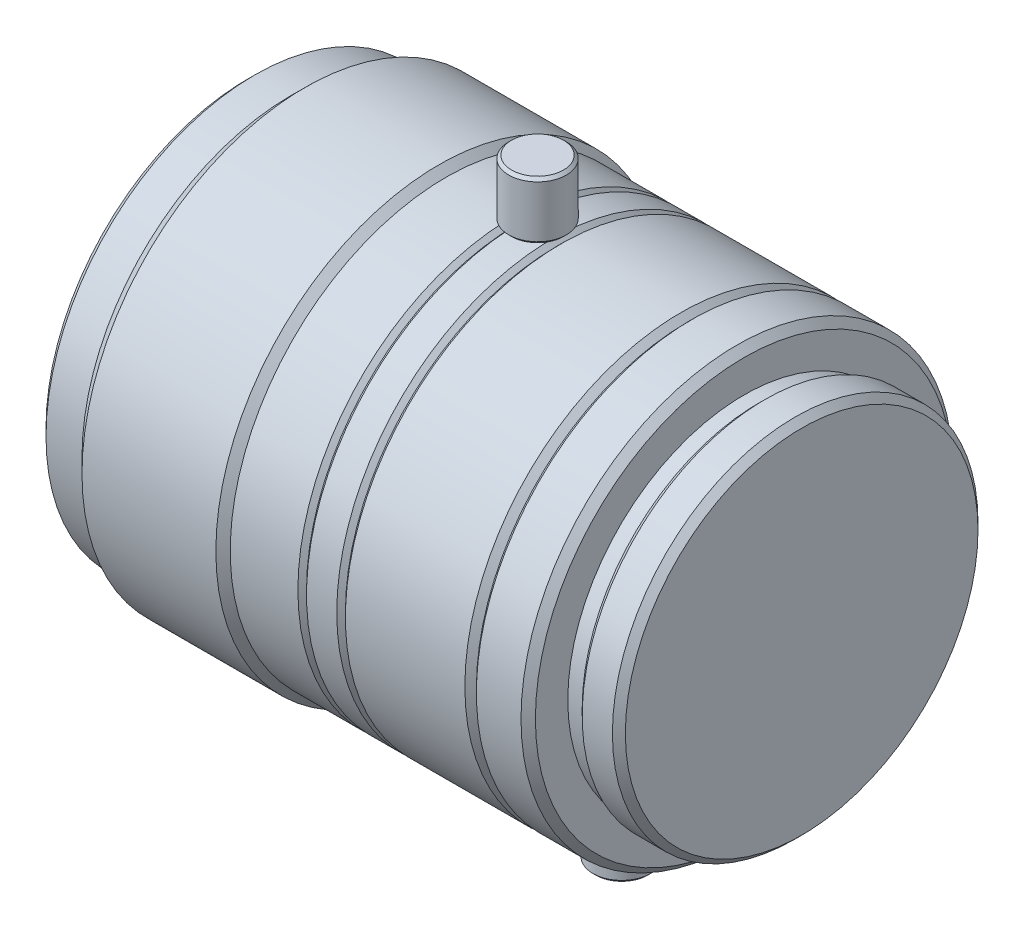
ISO-10303-21;
HEADER;
FILE_DESCRIPTION(('STEP AP214'),'2;1');
FILE_NAME('part.step','',(''),(''),'','','');
FILE_SCHEMA(('AUTOMOTIVE_DESIGN { 1 0 10303 214 1 1 1 1 }'));
ENDSEC;
DATA;
#1=APPLICATION_CONTEXT('core data for automotive mechanical design processes');
#2=APPLICATION_PROTOCOL_DEFINITION('international standard','automotive_design',2000,#1);
#3=PRODUCT_CONTEXT('',#1,'mechanical');
#4=PRODUCT('Part','Part','',(#3));
#5=PRODUCT_RELATED_PRODUCT_CATEGORY('part','',(#4));
#6=PRODUCT_DEFINITION_FORMATION('','',#4);
#7=PRODUCT_DEFINITION_CONTEXT('part definition',#1,'design');
#8=PRODUCT_DEFINITION('design','',#6,#7);
#9=PRODUCT_DEFINITION_SHAPE('','',#8);
#10=(LENGTH_UNIT() NAMED_UNIT(*) SI_UNIT(.MILLI.,.METRE.));
#11=(NAMED_UNIT(*) PLANE_ANGLE_UNIT() SI_UNIT($,.RADIAN.));
#12=(NAMED_UNIT(*) SI_UNIT($,.STERADIAN.) SOLID_ANGLE_UNIT());
#13=UNCERTAINTY_MEASURE_WITH_UNIT(LENGTH_MEASURE(1.E-05),#10,'distance_accuracy_value','');
#14=(GEOMETRIC_REPRESENTATION_CONTEXT(3) GLOBAL_UNCERTAINTY_ASSIGNED_CONTEXT((#13)) GLOBAL_UNIT_ASSIGNED_CONTEXT((#10,
#11,#12)) REPRESENTATION_CONTEXT('',''));
#15=CARTESIAN_POINT('',(0.,0.,0.));
#16=DIRECTION('',(0.,0.,1.));
#17=DIRECTION('',(1.,0.,0.));
#18=AXIS2_PLACEMENT_3D('',#15,#16,#17);
#19=CARTESIAN_POINT('',(-9.24999999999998,-15.,0.));
#20=DIRECTION('',(0.,-1.,0.));
#21=DIRECTION('',(0.,0.,-1.));
#22=AXIS2_PLACEMENT_3D('',#19,#20,#21);
#23=PLANE('',#22);
#24=CARTESIAN_POINT('',(-8.4999999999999,-15.,0.));
#25=DIRECTION('',(0.,-1.,0.));
#26=DIRECTION('',(0.,0.,-1.));
#27=AXIS2_PLACEMENT_3D('',#24,#25,#26);
#28=CIRCLE('',#27,0.750000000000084);
#29=CARTESIAN_POINT('',(-8.4999999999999,-15.,-0.750000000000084));
#30=VERTEX_POINT('',#29);
#31=EDGE_CURVE('P0_E17',#30,#30,#28,.T.);
#32=ORIENTED_EDGE('',*,*,#31,.F.);
#33=EDGE_LOOP('',(#32));
#34=FACE_BOUND('',#33,.T.);
#35=ADVANCED_FACE('P0_F14',(#34),#23,.F.);
#36=CARTESIAN_POINT('',(-8.4999999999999,-20.,0.));
#37=DIRECTION('',(0.,-1.,0.));
#38=DIRECTION('',(0.,0.,-1.));
#39=AXIS2_PLACEMENT_3D('',#36,#37,#38);
#40=CYLINDRICAL_SURFACE('',#39,0.750000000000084);
#41=CARTESIAN_POINT('',(-8.4999999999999,-16.,0.));
#42=DIRECTION('',(0.,-1.,0.));
#43=DIRECTION('',(0.,0.,-1.));
#44=AXIS2_PLACEMENT_3D('',#41,#42,#43);
#45=CIRCLE('',#44,0.750000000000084);
#46=CARTESIAN_POINT('',(-8.4999999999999,-16.,-0.750000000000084));
#47=VERTEX_POINT('',#46);
#48=EDGE_CURVE('P0_E33',#47,#47,#45,.F.);
#49=ORIENTED_EDGE('',*,*,#48,.T.);
#50=EDGE_LOOP('',(#49));
#51=FACE_BOUND('',#50,.T.);
#52=ORIENTED_EDGE('',*,*,#31,.T.);
#53=EDGE_LOOP('',(#52));
#54=FACE_BOUND('',#53,.T.);
#55=ADVANCED_FACE('P0_F40',(#51,#54),#40,.T.);
#56=CARTESIAN_POINT('',(-10.2999999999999,-16.,0.));
#57=DIRECTION('',(0.,-1.,0.));
#58=DIRECTION('',(0.,0.,-1.));
#59=AXIS2_PLACEMENT_3D('',#56,#57,#58);
#60=PLANE('',#59);
#61=ORIENTED_EDGE('',*,*,#48,.F.);
#62=EDGE_LOOP('',(#61));
#63=FACE_BOUND('',#62,.T.);
#64=CARTESIAN_POINT('',(-8.4999999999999,-16.0000000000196,0.));
#65=DIRECTION('',(0.,-1.,0.));
#66=DIRECTION('',(0.,0.,-1.));
#67=AXIS2_PLACEMENT_3D('',#64,#65,#66);
#68=CIRCLE('',#67,1.80000000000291);
#69=CARTESIAN_POINT('',(-8.4999999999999,-16.0000000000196,-1.80000000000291));
#70=VERTEX_POINT('',#69);
#71=EDGE_CURVE('P0_E31',#70,#70,#68,.T.);
#72=ORIENTED_EDGE('',*,*,#71,.F.);
#73=EDGE_LOOP('',(#72));
#74=FACE_BOUND('',#73,.T.);
#75=ADVANCED_FACE('P0_F47',(#63,#74),#60,.F.);
#76=CARTESIAN_POINT('',(-8.4999999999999,-20.,0.));
#77=DIRECTION('',(0.,1.,0.));
#78=DIRECTION('',(0.,0.,1.));
#79=AXIS2_PLACEMENT_3D('',#76,#77,#78);
#80=PLANE('',#79);
#81=CARTESIAN_POINT('',(-8.4999999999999,-19.9999999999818,0.));
#82=DIRECTION('',(0.,1.,0.));
#83=DIRECTION('',(0.,0.,1.));
#84=AXIS2_PLACEMENT_3D('',#81,#82,#83);
#85=CIRCLE('',#84,1.80000000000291);
#86=CARTESIAN_POINT('',(-8.4999999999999,-19.9999999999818,1.80000000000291));
#87=VERTEX_POINT('',#86);
#88=EDGE_CURVE('P0_E26',#87,#87,#85,.T.);
#89=ORIENTED_EDGE('',*,*,#88,.F.);
#90=EDGE_LOOP('',(#89));
#91=FACE_BOUND('',#90,.T.);
#92=ADVANCED_FACE('P0_F62',(#91),#80,.F.);
#93=CARTESIAN_POINT('',(-8.4999999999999,-16.1999999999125,0.));
#94=DIRECTION('',(0.,-1.,0.));
#95=DIRECTION('',(0.,0.,-1.));
#96=AXIS2_PLACEMENT_3D('',#93,#94,#95);
#97=CONICAL_SURFACE('',#96,1.99999999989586,0.785398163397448);
#98=CARTESIAN_POINT('',(-8.4999999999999,-16.2,0.));
#99=DIRECTION('',(0.,-1.,0.));
#100=DIRECTION('',(0.,0.,-1.));
#101=AXIS2_PLACEMENT_3D('',#98,#99,#100);
#102=CIRCLE('',#101,2.);
#103=CARTESIAN_POINT('',(-8.4999999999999,-16.2,-2.));
#104=VERTEX_POINT('',#103);
#105=EDGE_CURVE('P0_E21',#104,#104,#102,.T.);
#106=ORIENTED_EDGE('',*,*,#105,.F.);
#107=EDGE_LOOP('',(#106));
#108=FACE_BOUND('',#107,.T.);
#109=ORIENTED_EDGE('',*,*,#71,.T.);
#110=EDGE_LOOP('',(#109));
#111=FACE_BOUND('',#110,.T.);
#112=ADVANCED_FACE('P0_F55',(#108,#111),#97,.T.);
#113=CARTESIAN_POINT('',(-8.4999999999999,-19.800000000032,0.));
#114=DIRECTION('',(0.,1.,0.));
#115=DIRECTION('',(0.,0.,1.));
#116=AXIS2_PLACEMENT_3D('',#113,#114,#115);
#117=CONICAL_SURFACE('',#116,1.99999999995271,0.785398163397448);
#118=CARTESIAN_POINT('',(-8.4999999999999,-19.8,0.));
#119=DIRECTION('',(0.,-1.,0.));
#120=DIRECTION('',(0.,0.,-1.));
#121=AXIS2_PLACEMENT_3D('',#118,#119,#120);
#122=CIRCLE('',#121,2.);
#123=CARTESIAN_POINT('',(-8.4999999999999,-19.8,-2.));
#124=VERTEX_POINT('',#123);
#125=EDGE_CURVE('P0_E10',#124,#124,#122,.F.);
#126=ORIENTED_EDGE('',*,*,#125,.F.);
#127=EDGE_LOOP('',(#126));
#128=FACE_BOUND('',#127,.T.);
#129=ORIENTED_EDGE('',*,*,#88,.T.);
#130=EDGE_LOOP('',(#129));
#131=FACE_BOUND('',#130,.T.);
#132=ADVANCED_FACE('P0_F50',(#128,#131),#117,.T.);
#133=CARTESIAN_POINT('',(-8.4999999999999,-20.,0.));
#134=DIRECTION('',(0.,-1.,0.));
#135=DIRECTION('',(0.,0.,-1.));
#136=AXIS2_PLACEMENT_3D('',#133,#134,#135);
#137=CYLINDRICAL_SURFACE('',#136,2.);
#138=ORIENTED_EDGE('',*,*,#125,.T.);
#139=EDGE_LOOP('',(#138));
#140=FACE_BOUND('',#139,.T.);
#141=ORIENTED_EDGE('',*,*,#105,.T.);
#142=EDGE_LOOP('',(#141));
#143=FACE_BOUND('',#142,.T.);
#144=ADVANCED_FACE('P0_F48',(#140,#143),#137,.T.);
#145=CLOSED_SHELL('',(#35,#55,#75,#92,#112,#132,#144));
#146=MANIFOLD_SOLID_BREP('P0_B1',#145);
#147=CARTESIAN_POINT('',(-15.1,15.,0.));
#148=DIRECTION('',(0.,-1.,0.));
#149=DIRECTION('',(1.,0.,0.));
#150=AXIS2_PLACEMENT_3D('',#147,#148,#149);
#151=PLANE('',#150);
#152=CARTESIAN_POINT('',(-14.35,15.,0.));
#153=DIRECTION('',(0.,1.,0.));
#154=DIRECTION('',(-1.,0.,0.));
#155=AXIS2_PLACEMENT_3D('',#152,#153,#154);
#156=CIRCLE('',#155,0.750000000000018);
#157=CARTESIAN_POINT('',(-15.1,15.,0.));
#158=VERTEX_POINT('',#157);
#159=EDGE_CURVE('P1_E17',#158,#158,#156,.T.);
#160=ORIENTED_EDGE('',*,*,#159,.F.);
#161=EDGE_LOOP('',(#160));
#162=FACE_BOUND('',#161,.T.);
#163=ADVANCED_FACE('P1_F14',(#162),#151,.T.);
#164=CARTESIAN_POINT('',(-14.35,19.5,0.));
#165=DIRECTION('',(0.,1.,0.));
#166=DIRECTION('',(-1.,0.,0.));
#167=AXIS2_PLACEMENT_3D('',#164,#165,#166);
#168=CYLINDRICAL_SURFACE('',#167,0.750000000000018);
#169=ORIENTED_EDGE('',*,*,#159,.T.);
#170=EDGE_LOOP('',(#169));
#171=FACE_BOUND('',#170,.T.);
#172=CARTESIAN_POINT('',(-14.35,15.4999999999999,0.));
#173=DIRECTION('',(0.,1.,0.));
#174=DIRECTION('',(-1.,0.,0.));
#175=AXIS2_PLACEMENT_3D('',#172,#173,#174);
#176=CIRCLE('',#175,0.750000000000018);
#177=CARTESIAN_POINT('',(-15.1,15.4999999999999,0.));
#178=VERTEX_POINT('',#177);
#179=EDGE_CURVE('P1_E33',#178,#178,#176,.T.);
#180=ORIENTED_EDGE('',*,*,#179,.F.);
#181=EDGE_LOOP('',(#180));
#182=FACE_BOUND('',#181,.T.);
#183=ADVANCED_FACE('P1_F40',(#171,#182),#168,.T.);
#184=CARTESIAN_POINT('',(-16.15,15.4999999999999,0.));
#185=DIRECTION('',(0.,-1.,0.));
#186=DIRECTION('',(1.,0.,0.));
#187=AXIS2_PLACEMENT_3D('',#184,#185,#186);
#188=PLANE('',#187);
#189=CARTESIAN_POINT('',(-14.35,15.4999999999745,0.));
#190=DIRECTION('',(0.,1.,0.));
#191=DIRECTION('',(0.,0.,1.));
#192=AXIS2_PLACEMENT_3D('',#189,#190,#191);
#193=CIRCLE('',#192,1.80000000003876);
#194=CARTESIAN_POINT('',(-14.35,15.4999999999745,1.80000000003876));
#195=VERTEX_POINT('',#194);
#196=EDGE_CURVE('P1_E31',#195,#195,#193,.T.);
#197=ORIENTED_EDGE('',*,*,#196,.F.);
#198=EDGE_LOOP('',(#197));
#199=FACE_BOUND('',#198,.T.);
#200=ORIENTED_EDGE('',*,*,#179,.T.);
#201=EDGE_LOOP('',(#200));
#202=FACE_BOUND('',#201,.T.);
#203=ADVANCED_FACE('P1_F48',(#199,#202),#188,.T.);
#204=CARTESIAN_POINT('',(-14.35,19.5,0.));
#205=DIRECTION('',(0.,1.,0.));
#206=DIRECTION('',(-1.,0.,0.));
#207=AXIS2_PLACEMENT_3D('',#204,#205,#206);
#208=PLANE('',#207);
#209=CARTESIAN_POINT('',(-14.35,19.4999999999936,0.));
#210=DIRECTION('',(0.,-1.,0.));
#211=DIRECTION('',(1.,0.,0.));
#212=AXIS2_PLACEMENT_3D('',#209,#210,#211);
#213=CIRCLE('',#212,1.80000000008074);
#214=CARTESIAN_POINT('',(-12.5499999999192,19.4999999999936,0.));
#215=VERTEX_POINT('',#214);
#216=EDGE_CURVE('P1_E26',#215,#215,#213,.T.);
#217=ORIENTED_EDGE('',*,*,#216,.F.);
#218=EDGE_LOOP('',(#217));
#219=FACE_BOUND('',#218,.T.);
#220=ADVANCED_FACE('P1_F63',(#219),#208,.T.);
#221=CARTESIAN_POINT('',(-14.35,15.6999999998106,0.));
#222=DIRECTION('',(0.,1.,0.));
#223=DIRECTION('',(0.,0.,1.));
#224=AXIS2_PLACEMENT_3D('',#221,#222,#223);
#225=CONICAL_SURFACE('',#224,1.99999999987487,0.785398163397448);
#226=ORIENTED_EDGE('',*,*,#196,.T.);
#227=EDGE_LOOP('',(#226));
#228=FACE_BOUND('',#227,.T.);
#229=CARTESIAN_POINT('',(-14.35,15.7,0.));
#230=DIRECTION('',(0.,1.,0.));
#231=DIRECTION('',(-1.,0.,0.));
#232=AXIS2_PLACEMENT_3D('',#229,#230,#231);
#233=CIRCLE('',#232,1.99999999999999);
#234=CARTESIAN_POINT('',(-16.35,15.7,0.));
#235=VERTEX_POINT('',#234);
#236=EDGE_CURVE('P1_E21',#235,#235,#233,.T.);
#237=ORIENTED_EDGE('',*,*,#236,.F.);
#238=EDGE_LOOP('',(#237));
#239=FACE_BOUND('',#238,.T.);
#240=ADVANCED_FACE('P1_F57',(#228,#239),#225,.T.);
#241=CARTESIAN_POINT('',(-14.35,19.3000000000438,0.));
#242=DIRECTION('',(0.,-1.,0.));
#243=DIRECTION('',(1.,0.,0.));
#244=AXIS2_PLACEMENT_3D('',#241,#242,#243);
#245=CONICAL_SURFACE('',#244,2.00000000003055,0.785398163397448);
#246=CARTESIAN_POINT('',(-14.35,19.3,0.));
#247=DIRECTION('',(0.,1.,0.));
#248=DIRECTION('',(-1.,0.,0.));
#249=AXIS2_PLACEMENT_3D('',#246,#247,#248);
#250=CIRCLE('',#249,1.99999999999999);
#251=CARTESIAN_POINT('',(-16.35,19.3,0.));
#252=VERTEX_POINT('',#251);
#253=EDGE_CURVE('P1_E10',#252,#252,#250,.F.);
#254=ORIENTED_EDGE('',*,*,#253,.F.);
#255=EDGE_LOOP('',(#254));
#256=FACE_BOUND('',#255,.T.);
#257=ORIENTED_EDGE('',*,*,#216,.T.);
#258=EDGE_LOOP('',(#257));
#259=FACE_BOUND('',#258,.T.);
#260=ADVANCED_FACE('P1_F51',(#256,#259),#245,.T.);
#261=CARTESIAN_POINT('',(-14.35,19.5,0.));
#262=DIRECTION('',(0.,1.,0.));
#263=DIRECTION('',(-1.,0.,0.));
#264=AXIS2_PLACEMENT_3D('',#261,#262,#263);
#265=CYLINDRICAL_SURFACE('',#264,1.99999999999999);
#266=ORIENTED_EDGE('',*,*,#236,.T.);
#267=EDGE_LOOP('',(#266));
#268=FACE_BOUND('',#267,.T.);
#269=ORIENTED_EDGE('',*,*,#253,.T.);
#270=EDGE_LOOP('',(#269));
#271=FACE_BOUND('',#270,.T.);
#272=ADVANCED_FACE('P1_F49',(#268,#271),#265,.T.);
#273=CLOSED_SHELL('',(#163,#183,#203,#220,#240,#260,#272));
#274=MANIFOLD_SOLID_BREP('P1_B1',#273);
#275=CARTESIAN_POINT('',(-7.90986787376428,0.,0.));
#276=DIRECTION('',(0.,1.,0.));
#277=DIRECTION('',(-1.,0.,0.));
#278=AXIS2_PLACEMENT_3D('',#275,#276,#277);
#279=SPHERICAL_SURFACE('',#278,26.5901321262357);
#280=CARTESIAN_POINT('',(-31.3786796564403,-12.5,0.));
#281=CARTESIAN_POINT('',(-31.3786796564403,-12.4999980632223,-0.350925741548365));
#282=CARTESIAN_POINT('',(-31.3786796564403,-12.4852097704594,-0.70191507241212));
#283=CARTESIAN_POINT('',(-31.3786796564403,-12.4261423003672,-1.40154352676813));
#284=CARTESIAN_POINT('',(-31.3786796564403,-12.3818485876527,-1.75018140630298));
#285=CARTESIAN_POINT('',(-31.3786796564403,-12.2639605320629,-2.44315774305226));
#286=CARTESIAN_POINT('',(-31.3786796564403,-12.1903107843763,-2.78748679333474));
#287=CARTESIAN_POINT('',(-31.3786796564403,-12.0142351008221,-3.46870681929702));
#288=CARTESIAN_POINT('',(-31.3786796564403,-11.911808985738,-3.80559774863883));
#289=CARTESIAN_POINT('',(-31.3786796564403,-11.6790100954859,-4.46925905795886));
#290=CARTESIAN_POINT('',(-31.3786796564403,-11.5486612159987,-4.79603781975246));
#291=CARTESIAN_POINT('',(-31.3786796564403,-11.2608879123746,-5.43745955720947));
#292=CARTESIAN_POINT('',(-31.3786796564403,-11.1034626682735,-5.75210216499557));
#293=CARTESIAN_POINT('',(-31.3786796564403,-10.7627419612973,-6.3668538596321));
#294=CARTESIAN_POINT('',(-31.3786796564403,-10.5794590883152,-6.66696992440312));
#295=CARTESIAN_POINT('',(-31.3786796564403,-10.1882694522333,-7.25069695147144));
#296=CARTESIAN_POINT('',(-31.3786796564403,-9.98036287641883,-7.53430803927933));
#297=CARTESIAN_POINT('',(-31.3786796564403,-9.5413588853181,-8.08306624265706));
#298=CARTESIAN_POINT('',(-31.3786796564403,-9.31025691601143,-8.34820971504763));
#299=CARTESIAN_POINT('',(-31.3786796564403,-8.82653862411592,-8.85808702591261));
#300=CARTESIAN_POINT('',(-31.3786796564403,-8.57392225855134,-9.10282082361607));
#301=CARTESIAN_POINT('',(-31.3786796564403,-8.04894889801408,-9.57015843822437));
#302=CARTESIAN_POINT('',(-31.3786796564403,-7.77659021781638,-9.79276036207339));
#303=CARTESIAN_POINT('',(-31.3786796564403,-7.21408789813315,-10.2142276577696));
#304=CARTESIAN_POINT('',(-31.3786796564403,-6.92394426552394,-10.4130930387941));
#305=CARTESIAN_POINT('',(-31.3786796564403,-6.32794608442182,-10.7856664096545));
#306=CARTESIAN_POINT('',(-31.3786796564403,-6.02209212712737,-10.9593753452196));
#307=CARTESIAN_POINT('',(-31.3786796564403,-5.39683771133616,-11.2804097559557));
#308=CARTESIAN_POINT('',(-31.3786796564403,-5.07743725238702,-11.4277352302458));
#309=CARTESIAN_POINT('',(-31.3786796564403,-4.42736410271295,-11.6949538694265));
#310=CARTESIAN_POINT('',(-31.3786796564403,-4.09669153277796,-11.8148473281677));
#311=CARTESIAN_POINT('',(-31.3786796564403,-3.42642177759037,-12.0263515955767));
#312=CARTESIAN_POINT('',(-31.3786796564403,-3.0868245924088,-12.1179624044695));
#313=CARTESIAN_POINT('',(-31.3786796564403,-2.40111807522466,-12.2722504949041));
#314=CARTESIAN_POINT('',(-31.3786796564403,-2.05500870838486,-12.3349276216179));
#315=CARTESIAN_POINT('',(-31.3786796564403,-1.35874022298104,-12.4309020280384));
#316=CARTESIAN_POINT('',(-31.3786796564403,-1.00858110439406,-12.4641993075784));
#317=CARTESIAN_POINT('',(-31.3786796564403,-0.306702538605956,-12.5011772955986));
#318=CARTESIAN_POINT('',(-31.3786796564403,0.0450169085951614,-12.5048580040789));
#319=CARTESIAN_POINT('',(-31.3786796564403,0.747515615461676,-12.4825766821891));
#320=CARTESIAN_POINT('',(-31.3786796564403,1.09829487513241,-12.4566146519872));
#321=CARTESIAN_POINT('',(-31.3786796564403,1.79641750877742,-12.3752326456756));
#322=CARTESIAN_POINT('',(-31.3786796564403,2.14376090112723,-12.3198128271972));
#323=CARTESIAN_POINT('',(-31.3786796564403,2.83254433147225,-12.1799093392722));
#324=CARTESIAN_POINT('',(-31.3786796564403,3.17398436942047,-12.0954256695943));
#325=CARTESIAN_POINT('',(-31.3786796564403,3.84853729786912,-11.8979940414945));
#326=CARTESIAN_POINT('',(-31.3786796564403,4.1816500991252,-11.7850457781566));
#327=CARTESIAN_POINT('',(-31.3786796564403,4.83717648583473,-11.5314884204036));
#328=CARTESIAN_POINT('',(-31.3786796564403,5.15959007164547,-11.3908793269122));
#329=CARTESIAN_POINT('',(-31.3786796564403,5.79143774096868,-11.0829941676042));
#330=CARTESIAN_POINT('',(-31.3786796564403,6.10087133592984,-10.9157170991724));
#331=CARTESIAN_POINT('',(-31.3786796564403,6.70454619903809,-10.5556890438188));
#332=CARTESIAN_POINT('',(-31.3786796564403,6.99878746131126,-10.3629380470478));
#333=CARTESIAN_POINT('',(-31.3786796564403,7.56996103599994,-9.95335017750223));
#334=CARTESIAN_POINT('',(-31.3786796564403,7.84689482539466,-9.73651536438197));
#335=CARTESIAN_POINT('',(-31.3786796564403,8.3815116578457,-9.280288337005));
#336=CARTESIAN_POINT('',(-31.3786796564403,8.63919473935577,-9.0408961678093));
#337=CARTESIAN_POINT('',(-31.3786796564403,9.13343029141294,-8.54130504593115));
#338=CARTESIAN_POINT('',(-31.3786796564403,9.36998690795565,-8.28111019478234));
#339=CARTESIAN_POINT('',(-31.3786796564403,9.8203472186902,-7.741719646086));
#340=CARTESIAN_POINT('',(-31.3786796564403,10.0341507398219,-7.46252380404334));
#341=CARTESIAN_POINT('',(-31.3786796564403,10.4375814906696,-6.88697721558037));
#342=CARTESIAN_POINT('',(-31.3786796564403,10.6271969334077,-6.59061820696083));
#343=CARTESIAN_POINT('',(-31.3786796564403,10.9807757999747,-5.98298566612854));
#344=CARTESIAN_POINT('',(-31.3786796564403,11.144740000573,-5.67171258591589));
#345=CARTESIAN_POINT('',(-31.3786796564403,11.4459856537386,-5.03618704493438));
#346=CARTESIAN_POINT('',(-31.3786796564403,11.5832442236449,-4.71192373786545));
#347=CARTESIAN_POINT('',(-31.3786796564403,11.829925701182,-4.05297638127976));
#348=CARTESIAN_POINT('',(-31.3786796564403,11.939348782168,-3.71829239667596));
#349=CARTESIAN_POINT('',(-31.3786796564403,12.1294000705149,-3.04153963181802));
#350=CARTESIAN_POINT('',(-31.3786796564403,12.2100823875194,-2.69948602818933));
#351=CARTESIAN_POINT('',(-31.3786796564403,12.3423377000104,-2.00993728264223));
#352=CARTESIAN_POINT('',(-31.3786796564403,12.3939250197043,-1.66244490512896));
#353=CARTESIAN_POINT('',(-31.3786796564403,12.4538490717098,-1.09534467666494));
#354=CARTESIAN_POINT('',(-31.3786796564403,12.4711502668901,-0.876645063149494));
#355=CARTESIAN_POINT('',(-31.3786796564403,12.4942263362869,-0.438638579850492));
#356=CARTESIAN_POINT('',(-31.3786796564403,12.5000012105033,-0.21933171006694));
#357=CARTESIAN_POINT('',(-31.3786796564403,12.4999980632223,0.350925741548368));
#358=CARTESIAN_POINT('',(-31.3786796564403,12.4852097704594,0.701915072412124));
#359=CARTESIAN_POINT('',(-31.3786796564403,12.4261423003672,1.40154352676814));
#360=CARTESIAN_POINT('',(-31.3786796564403,12.3818485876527,1.750181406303));
#361=CARTESIAN_POINT('',(-31.3786796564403,12.2639605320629,2.44315774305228));
#362=CARTESIAN_POINT('',(-31.3786796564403,12.1903107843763,2.78748679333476));
#363=CARTESIAN_POINT('',(-31.3786796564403,12.0142351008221,3.46870681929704));
#364=CARTESIAN_POINT('',(-31.3786796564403,11.911808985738,3.80559774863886));
#365=CARTESIAN_POINT('',(-31.3786796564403,11.6790100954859,4.46925905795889));
#366=CARTESIAN_POINT('',(-31.3786796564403,11.5486612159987,4.79603781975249));
#367=CARTESIAN_POINT('',(-31.3786796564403,11.2608879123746,5.43745955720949));
#368=CARTESIAN_POINT('',(-31.3786796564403,11.1034626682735,5.7521021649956));
#369=CARTESIAN_POINT('',(-31.3786796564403,10.7627419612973,6.36685385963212));
#370=CARTESIAN_POINT('',(-31.3786796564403,10.5794590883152,6.66696992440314));
#371=CARTESIAN_POINT('',(-31.3786796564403,10.1882694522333,7.25069695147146));
#372=CARTESIAN_POINT('',(-31.3786796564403,9.98036287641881,7.53430803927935));
#373=CARTESIAN_POINT('',(-31.3786796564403,9.5413588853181,8.08306624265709));
#374=CARTESIAN_POINT('',(-31.3786796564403,9.31025691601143,8.34820971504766));
#375=CARTESIAN_POINT('',(-31.3786796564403,8.82653862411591,8.85808702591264));
#376=CARTESIAN_POINT('',(-31.3786796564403,8.57392225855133,9.1028208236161));
#377=CARTESIAN_POINT('',(-31.3786796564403,8.04894889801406,9.5701584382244));
#378=CARTESIAN_POINT('',(-31.3786796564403,7.77659021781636,9.79276036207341));
#379=CARTESIAN_POINT('',(-31.3786796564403,7.21408789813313,10.2142276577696));
#380=CARTESIAN_POINT('',(-31.3786796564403,6.92394426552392,10.4130930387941));
#381=CARTESIAN_POINT('',(-31.3786796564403,6.32794608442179,10.7856664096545));
#382=CARTESIAN_POINT('',(-31.3786796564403,6.02209212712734,10.9593753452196));
#383=CARTESIAN_POINT('',(-31.3786796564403,5.39683771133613,11.2804097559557));
#384=CARTESIAN_POINT('',(-31.3786796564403,5.07743725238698,11.4277352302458));
#385=CARTESIAN_POINT('',(-31.3786796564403,4.42736410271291,11.6949538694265));
#386=CARTESIAN_POINT('',(-31.3786796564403,4.09669153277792,11.8148473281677));
#387=CARTESIAN_POINT('',(-31.3786796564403,3.42642177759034,12.0263515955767));
#388=CARTESIAN_POINT('',(-31.3786796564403,3.08682459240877,12.1179624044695));
#389=CARTESIAN_POINT('',(-31.3786796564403,2.40111807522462,12.2722504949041));
#390=CARTESIAN_POINT('',(-31.3786796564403,2.05500870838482,12.3349276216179));
#391=CARTESIAN_POINT('',(-31.3786796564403,1.358740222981,12.4309020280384));
#392=CARTESIAN_POINT('',(-31.3786796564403,1.00858110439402,12.4641993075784));
#393=CARTESIAN_POINT('',(-31.3786796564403,0.306702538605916,12.5011772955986));
#394=CARTESIAN_POINT('',(-31.3786796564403,-0.0450169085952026,12.5048580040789));
#395=CARTESIAN_POINT('',(-31.3786796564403,-0.747515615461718,12.4825766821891));
#396=CARTESIAN_POINT('',(-31.3786796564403,-1.09829487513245,12.4566146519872));
#397=CARTESIAN_POINT('',(-31.3786796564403,-1.79641750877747,12.3752326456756));
#398=CARTESIAN_POINT('',(-31.3786796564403,-2.14376090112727,12.3198128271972));
#399=CARTESIAN_POINT('',(-31.3786796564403,-2.83254433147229,12.1799093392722));
#400=CARTESIAN_POINT('',(-31.3786796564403,-3.17398436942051,12.0954256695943));
#401=CARTESIAN_POINT('',(-31.3786796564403,-3.84853729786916,11.8979940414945));
#402=CARTESIAN_POINT('',(-31.3786796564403,-4.18165009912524,11.7850457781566));
#403=CARTESIAN_POINT('',(-31.3786796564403,-4.83717648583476,11.5314884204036));
#404=CARTESIAN_POINT('',(-31.3786796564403,-5.1595900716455,11.3908793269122));
#405=CARTESIAN_POINT('',(-31.3786796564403,-5.79143774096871,11.0829941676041));
#406=CARTESIAN_POINT('',(-31.3786796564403,-6.10087133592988,10.9157170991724));
#407=CARTESIAN_POINT('',(-31.3786796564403,-6.70454619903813,10.5556890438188));
#408=CARTESIAN_POINT('',(-31.3786796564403,-6.99878746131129,10.3629380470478));
#409=CARTESIAN_POINT('',(-31.3786796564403,-7.56996103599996,9.95335017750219));
#410=CARTESIAN_POINT('',(-31.3786796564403,-7.84689482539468,9.73651536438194));
#411=CARTESIAN_POINT('',(-31.3786796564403,-8.38151165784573,9.28028833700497));
#412=CARTESIAN_POINT('',(-31.3786796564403,-8.6391947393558,9.04089616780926));
#413=CARTESIAN_POINT('',(-31.3786796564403,-9.13343029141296,8.54130504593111));
#414=CARTESIAN_POINT('',(-31.3786796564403,-9.36998690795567,8.2811101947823));
#415=CARTESIAN_POINT('',(-31.3786796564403,-9.82034721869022,7.74171964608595));
#416=CARTESIAN_POINT('',(-31.3786796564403,-10.0341507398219,7.4625238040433));
#417=CARTESIAN_POINT('',(-31.3786796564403,-10.4375814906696,6.88697721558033));
#418=CARTESIAN_POINT('',(-31.3786796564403,-10.6271969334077,6.5906182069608));
#419=CARTESIAN_POINT('',(-31.3786796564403,-10.9807757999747,5.98298566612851));
#420=CARTESIAN_POINT('',(-31.3786796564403,-11.144740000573,5.67171258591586));
#421=CARTESIAN_POINT('',(-31.3786796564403,-11.4459856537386,5.03618704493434));
#422=CARTESIAN_POINT('',(-31.3786796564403,-11.5832442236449,4.71192373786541));
#423=CARTESIAN_POINT('',(-31.3786796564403,-11.829925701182,4.05297638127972));
#424=CARTESIAN_POINT('',(-31.3786796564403,-11.939348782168,3.71829239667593));
#425=CARTESIAN_POINT('',(-31.3786796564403,-12.1294000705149,3.04153963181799));
#426=CARTESIAN_POINT('',(-31.3786796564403,-12.2100823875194,2.6994860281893));
#427=CARTESIAN_POINT('',(-31.3786796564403,-12.3423377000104,2.00993728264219));
#428=CARTESIAN_POINT('',(-31.3786796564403,-12.3939250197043,1.66244490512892));
#429=CARTESIAN_POINT('',(-31.3786796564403,-12.4538490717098,1.09534467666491));
#430=CARTESIAN_POINT('',(-31.3786796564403,-12.4711502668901,0.876645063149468));
#431=CARTESIAN_POINT('',(-31.3786796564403,-12.4942263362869,0.43863857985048));
#432=CARTESIAN_POINT('',(-31.3786796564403,-12.5000012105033,0.219331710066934));
#433=CARTESIAN_POINT('',(-31.3786796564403,-12.5,0.));
#434=B_SPLINE_CURVE_WITH_KNOTS('',3,(#280,#281,#282,#283,#284,#285,#286,#287,#288,#289,#290,
#291,#292,#293,#294,#295,#296,#297,#298,#299,#300,#301,#302,#303,#304,#305,#306,#307,#308,#309,
#310,#311,#312,#313,#314,#315,#316,#317,#318,#319,#320,#321,#322,#323,#324,#325,#326,#327,#328,
#329,#330,#331,#332,#333,#334,#335,#336,#337,#338,#339,#340,#341,#342,#343,#344,#345,#346,#347,
#348,#349,#350,#351,#352,#353,#354,#355,#356,#357,#358,#359,#360,#361,#362,#363,#364,#365,#366,
#367,#368,#369,#370,#371,#372,#373,#374,#375,#376,#377,#378,#379,#380,#381,#382,#383,#384,#385,
#386,#387,#388,#389,#390,#391,#392,#393,#394,#395,#396,#397,#398,#399,#400,#401,#402,#403,#404,
#405,#406,#407,#408,#409,#410,#411,#412,#413,#414,#415,#416,#417,#418,#419,#420,#421,#422,#423,
#424,#425,#426,#427,#428,#429,#430,#431,#432,#433),.UNSPECIFIED.,.T.,.F.,(4,2,2,2,2,2,2,2,2,2,2,
2,2,2,2,2,2,2,2,2,2,2,2,2,2,2,2,2,2,2,2,2,2,2,2,2,2,2,2,2,2,2,2,2,2,2,2,2,2,2,2,2,2,2,2,2,2,2,2,
2,2,2,2,2,2,2,2,2,2,2,2,2,2,2,2,2,4),(0.,1.05257643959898,2.10567179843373,3.16076418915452,
4.21586315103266,5.27006276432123,6.32429430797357,7.37801431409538,8.43172630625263,
9.48564558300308,10.5395669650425,11.5935784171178,12.647589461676,13.7015608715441,
14.7555323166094,15.8094924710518,16.8634526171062,17.9174184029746,18.9713841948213,
20.025349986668,21.0793157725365,22.1332759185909,23.1872360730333,24.2412075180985,
25.2951789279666,26.3491899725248,27.4032014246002,28.4571228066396,29.51104208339,
30.5647540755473,31.6184740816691,32.6727056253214,33.72690523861,34.7820042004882,
35.8370965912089,36.8901919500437,37.9427683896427,38.6006380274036,39.2585076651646,
40.3110841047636,41.3641794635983,42.4192718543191,43.4743708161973,44.5285704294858,
45.5828019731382,46.63652197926,47.6902339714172,48.7441532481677,49.7980746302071,
50.8520860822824,51.9060971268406,52.9600685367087,54.014039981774,55.0680001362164,
56.1219602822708,57.1759260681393,58.2298918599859,59.2838576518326,60.3378234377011,
61.3917835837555,62.4457437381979,63.4997151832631,64.5536865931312,65.6076976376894,
66.6617090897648,67.7156304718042,68.7695497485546,69.8232617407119,70.8769817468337,
71.931213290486,72.9854129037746,74.0405118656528,75.0956042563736,76.1486996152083,
77.2012760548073,77.8591456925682,78.5170153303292),.UNSPECIFIED.);
#435=CARTESIAN_POINT('',(-31.3786796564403,-12.5,0.));
#436=VERTEX_POINT('',#435);
#437=EDGE_CURVE('P2_E19',#436,#436,#434,.T.);
#438=ORIENTED_EDGE('',*,*,#437,.F.);
#439=EDGE_LOOP('',(#438));
#440=FACE_BOUND('',#439,.T.);
#441=ADVANCED_FACE('P2_F14',(#440),#279,.T.);
#442=CARTESIAN_POINT('',(-31.3786796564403,12.5,0.));
#443=DIRECTION('',(-1.,0.,0.));
#444=DIRECTION('',(0.,0.,1.));
#445=AXIS2_PLACEMENT_3D('',#442,#443,#444);
#446=PLANE('',#445);
#447=CARTESIAN_POINT('',(-31.3786796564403,0.,0.));
#448=DIRECTION('',(1.,0.,0.));
#449=DIRECTION('',(0.,0.,-1.));
#450=AXIS2_PLACEMENT_3D('',#447,#448,#449);
#451=CIRCLE('',#450,13.5);
#452=CARTESIAN_POINT('',(-31.3786796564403,0.,-13.5));
#453=VERTEX_POINT('',#452);
#454=EDGE_CURVE('P2_E58',#453,#453,#451,.F.);
#455=ORIENTED_EDGE('',*,*,#454,.T.);
#456=EDGE_LOOP('',(#455));
#457=FACE_BOUND('',#456,.T.);
#458=ORIENTED_EDGE('',*,*,#437,.T.);
#459=EDGE_LOOP('',(#458));
#460=FACE_BOUND('',#459,.T.);
#461=ADVANCED_FACE('P2_F65',(#457,#460),#446,.T.);
#462=CARTESIAN_POINT('',(4.,0.,0.));
#463=DIRECTION('',(1.,0.,0.));
#464=DIRECTION('',(0.,0.,-1.));
#465=AXIS2_PLACEMENT_3D('',#462,#463,#464);
#466=CYLINDRICAL_SURFACE('',#465,13.5);
#467=ORIENTED_EDGE('',*,*,#454,.F.);
#468=EDGE_LOOP('',(#467));
#469=FACE_BOUND('',#468,.T.);
#470=CARTESIAN_POINT('',(-34.5,0.,0.));
#471=DIRECTION('',(1.,0.,0.));
#472=DIRECTION('',(0.,0.,-1.));
#473=AXIS2_PLACEMENT_3D('',#470,#471,#472);
#474=CIRCLE('',#473,13.5);
#475=CARTESIAN_POINT('',(-34.5,0.,-13.5));
#476=VERTEX_POINT('',#475);
#477=EDGE_CURVE('P2_E56',#476,#476,#474,.T.);
#478=ORIENTED_EDGE('',*,*,#477,.F.);
#479=EDGE_LOOP('',(#478));
#480=FACE_BOUND('',#479,.T.);
#481=ADVANCED_FACE('P2_F72',(#469,#480),#466,.F.);
#482=CARTESIAN_POINT('',(-34.5,14.,0.));
#483=DIRECTION('',(-1.,0.,0.));
#484=DIRECTION('',(0.,0.,1.));
#485=AXIS2_PLACEMENT_3D('',#482,#483,#484);
#486=PLANE('',#485);
#487=CARTESIAN_POINT('',(-34.5,0.,0.));
#488=DIRECTION('',(1.,0.,0.));
#489=DIRECTION('',(0.,0.,-1.));
#490=AXIS2_PLACEMENT_3D('',#487,#488,#489);
#491=CIRCLE('',#490,14.);
#492=CARTESIAN_POINT('',(-34.5,0.,-14.));
#493=VERTEX_POINT('',#492);
#494=EDGE_CURVE('P2_E52',#493,#493,#491,.T.);
#495=ORIENTED_EDGE('',*,*,#494,.F.);
#496=EDGE_LOOP('',(#495));
#497=FACE_BOUND('',#496,.T.);
#498=ORIENTED_EDGE('',*,*,#477,.T.);
#499=EDGE_LOOP('',(#498));
#500=FACE_BOUND('',#499,.T.);
#501=ADVANCED_FACE('P2_F166',(#497,#500),#486,.T.);
#502=CARTESIAN_POINT('',(-34.,0.,0.));
#503=DIRECTION('',(1.,0.,0.));
#504=DIRECTION('',(0.,0.,-1.));
#505=AXIS2_PLACEMENT_3D('',#502,#503,#504);
#506=CONICAL_SURFACE('',#505,14.5,0.785398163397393);
#507=CARTESIAN_POINT('',(-34.,0.,0.));
#508=DIRECTION('',(1.,0.,0.));
#509=DIRECTION('',(0.,0.,-1.));
#510=AXIS2_PLACEMENT_3D('',#507,#508,#509);
#511=CIRCLE('',#510,14.5);
#512=CARTESIAN_POINT('',(-34.,0.,-14.5));
#513=VERTEX_POINT('',#512);
#514=EDGE_CURVE('P2_E55',#513,#513,#511,.T.);
#515=ORIENTED_EDGE('',*,*,#514,.F.);
#516=EDGE_LOOP('',(#515));
#517=FACE_BOUND('',#516,.T.);
#518=ORIENTED_EDGE('',*,*,#494,.T.);
#519=EDGE_LOOP('',(#518));
#520=FACE_BOUND('',#519,.T.);
#521=ADVANCED_FACE('P2_F162',(#517,#520),#506,.T.);
#522=CARTESIAN_POINT('',(4.,0.,0.));
#523=DIRECTION('',(1.,0.,0.));
#524=DIRECTION('',(0.,0.,-1.));
#525=AXIS2_PLACEMENT_3D('',#522,#523,#524);
#526=CYLINDRICAL_SURFACE('',#525,14.5);
#527=CARTESIAN_POINT('',(-31.5,0.,0.));
#528=DIRECTION('',(1.,0.,0.));
#529=DIRECTION('',(0.,0.,-1.));
#530=AXIS2_PLACEMENT_3D('',#527,#528,#529);
#531=CIRCLE('',#530,14.5);
#532=CARTESIAN_POINT('',(-31.5,0.,-14.5));
#533=VERTEX_POINT('',#532);
#534=EDGE_CURVE('P2_E347',#533,#533,#531,.T.);
#535=ORIENTED_EDGE('',*,*,#534,.F.);
#536=EDGE_LOOP('',(#535));
#537=FACE_BOUND('',#536,.T.);
#538=ORIENTED_EDGE('',*,*,#514,.T.);
#539=EDGE_LOOP('',(#538));
#540=FACE_BOUND('',#539,.T.);
#541=ADVANCED_FACE('P2_F158',(#537,#540),#526,.T.);
#542=CARTESIAN_POINT('',(-30.5,0.,0.));
#543=DIRECTION('',(1.,0.,0.));
#544=DIRECTION('',(0.,0.,-1.));
#545=AXIS2_PLACEMENT_3D('',#542,#543,#544);
#546=CONICAL_SURFACE('',#545,15.5,0.785398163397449);
#547=CARTESIAN_POINT('',(-30.5,0.,0.));
#548=DIRECTION('',(1.,0.,0.));
#549=DIRECTION('',(0.,0.,-1.));
#550=AXIS2_PLACEMENT_3D('',#547,#548,#549);
#551=CIRCLE('',#550,15.5);
#552=CARTESIAN_POINT('',(-30.5,0.,-15.5));
#553=VERTEX_POINT('',#552);
#554=EDGE_CURVE('P2_E349',#553,#553,#551,.T.);
#555=ORIENTED_EDGE('',*,*,#554,.F.);
#556=EDGE_LOOP('',(#555));
#557=FACE_BOUND('',#556,.T.);
#558=ORIENTED_EDGE('',*,*,#534,.T.);
#559=EDGE_LOOP('',(#558));
#560=FACE_BOUND('',#559,.T.);
#561=ADVANCED_FACE('P2_F154',(#557,#560),#546,.T.);
#562=CARTESIAN_POINT('',(4.,0.,0.));
#563=DIRECTION('',(1.,0.,0.));
#564=DIRECTION('',(0.,0.,-1.));
#565=AXIS2_PLACEMENT_3D('',#562,#563,#564);
#566=CYLINDRICAL_SURFACE('',#565,15.5);
#567=CARTESIAN_POINT('',(-21.1999999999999,0.,0.));
#568=DIRECTION('',(-1.,0.,0.));
#569=DIRECTION('',(0.,0.,1.));
#570=AXIS2_PLACEMENT_3D('',#567,#568,#569);
#571=CIRCLE('',#570,15.5);
#572=CARTESIAN_POINT('',(-21.1999999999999,0.,15.5));
#573=VERTEX_POINT('',#572);
#574=EDGE_CURVE('P2_E354',#573,#573,#571,.F.);
#575=ORIENTED_EDGE('',*,*,#574,.F.);
#576=EDGE_LOOP('',(#575));
#577=FACE_BOUND('',#576,.T.);
#578=ORIENTED_EDGE('',*,*,#554,.T.);
#579=EDGE_LOOP('',(#578));
#580=FACE_BOUND('',#579,.T.);
#581=ADVANCED_FACE('P2_F150',(#577,#580),#566,.T.);
#582=CARTESIAN_POINT('',(-21.1999999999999,0.,0.));
#583=DIRECTION('',(-1.,0.,0.));
#584=DIRECTION('',(0.,0.,1.));
#585=AXIS2_PLACEMENT_3D('',#582,#583,#584);
#586=CONICAL_SURFACE('',#585,15.5,0.785398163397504);
#587=ORIENTED_EDGE('',*,*,#574,.T.);
#588=EDGE_LOOP('',(#587));
#589=FACE_BOUND('',#588,.T.);
#590=CARTESIAN_POINT('',(-20.7,0.,0.));
#591=DIRECTION('',(1.,0.,0.));
#592=DIRECTION('',(0.,0.,-1.));
#593=AXIS2_PLACEMENT_3D('',#590,#591,#592);
#594=CIRCLE('',#593,15.);
#595=CARTESIAN_POINT('',(-20.7,0.,-15.));
#596=VERTEX_POINT('',#595);
#597=EDGE_CURVE('P2_E357',#596,#596,#594,.T.);
#598=ORIENTED_EDGE('',*,*,#597,.F.);
#599=EDGE_LOOP('',(#598));
#600=FACE_BOUND('',#599,.T.);
#601=ADVANCED_FACE('P2_F146',(#589,#600),#586,.T.);
#602=CARTESIAN_POINT('',(4.,0.,0.));
#603=DIRECTION('',(1.,0.,0.));
#604=DIRECTION('',(0.,0.,-1.));
#605=AXIS2_PLACEMENT_3D('',#602,#603,#604);
#606=CYLINDRICAL_SURFACE('',#605,15.);
#607=CARTESIAN_POINT('',(-16.,0.,0.));
#608=DIRECTION('',(-1.,0.,0.));
#609=DIRECTION('',(0.,0.,1.));
#610=AXIS2_PLACEMENT_3D('',#607,#608,#609);
#611=CIRCLE('',#610,15.);
#612=CARTESIAN_POINT('',(-16.,0.,15.));
#613=VERTEX_POINT('',#612);
#614=EDGE_CURVE('P2_E360',#613,#613,#611,.F.);
#615=ORIENTED_EDGE('',*,*,#614,.F.);
#616=EDGE_LOOP('',(#615));
#617=FACE_BOUND('',#616,.T.);
#618=ORIENTED_EDGE('',*,*,#597,.T.);
#619=EDGE_LOOP('',(#618));
#620=FACE_BOUND('',#619,.T.);
#621=ADVANCED_FACE('P2_F142',(#617,#620),#606,.T.);
#622=CARTESIAN_POINT('',(-16.,0.,0.));
#623=DIRECTION('',(-1.,0.,0.));
#624=DIRECTION('',(0.,0.,1.));
#625=AXIS2_PLACEMENT_3D('',#622,#623,#624);
#626=CONICAL_SURFACE('',#625,15.,0.785398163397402);
#627=ORIENTED_EDGE('',*,*,#614,.T.);
#628=EDGE_LOOP('',(#627));
#629=FACE_BOUND('',#628,.T.);
#630=CARTESIAN_POINT('',(-15.7,0.,0.));
#631=DIRECTION('',(1.,0.,0.));
#632=DIRECTION('',(0.,0.,-1.));
#633=AXIS2_PLACEMENT_3D('',#630,#631,#632);
#634=CIRCLE('',#633,14.7);
#635=CARTESIAN_POINT('',(-15.7,0.,-14.7));
#636=VERTEX_POINT('',#635);
#637=EDGE_CURVE('P2_E363',#636,#636,#634,.T.);
#638=ORIENTED_EDGE('',*,*,#637,.F.);
#639=EDGE_LOOP('',(#638));
#640=FACE_BOUND('',#639,.T.);
#641=ADVANCED_FACE('P2_F138',(#629,#640),#626,.T.);
#642=CARTESIAN_POINT('',(-15.4,0.,0.));
#643=DIRECTION('',(1.,0.,0.));
#644=DIRECTION('',(0.,0.,-1.));
#645=AXIS2_PLACEMENT_3D('',#642,#643,#644);
#646=CONICAL_SURFACE('',#645,15.,0.785398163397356);
#647=CARTESIAN_POINT('',(-15.4,0.,0.));
#648=DIRECTION('',(1.,0.,0.));
#649=DIRECTION('',(0.,0.,-1.));
#650=AXIS2_PLACEMENT_3D('',#647,#648,#649);
#651=CIRCLE('',#650,15.);
#652=CARTESIAN_POINT('',(-15.4,0.,-15.));
#653=VERTEX_POINT('',#652);
#654=EDGE_CURVE('P2_E366',#653,#653,#651,.T.);
#655=ORIENTED_EDGE('',*,*,#654,.F.);
#656=EDGE_LOOP('',(#655));
#657=FACE_BOUND('',#656,.T.);
#658=ORIENTED_EDGE('',*,*,#637,.T.);
#659=EDGE_LOOP('',(#658));
#660=FACE_BOUND('',#659,.T.);
#661=ADVANCED_FACE('P2_F134',(#657,#660),#646,.T.);
#662=CARTESIAN_POINT('',(4.,0.,0.));
#663=DIRECTION('',(1.,0.,0.));
#664=DIRECTION('',(0.,0.,-1.));
#665=AXIS2_PLACEMENT_3D('',#662,#663,#664);
#666=CYLINDRICAL_SURFACE('',#665,15.);
#667=CARTESIAN_POINT('',(-13.2999999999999,0.,0.));
#668=DIRECTION('',(-1.,0.,0.));
#669=DIRECTION('',(0.,0.,1.));
#670=AXIS2_PLACEMENT_3D('',#667,#668,#669);
#671=CIRCLE('',#670,15.);
#672=CARTESIAN_POINT('',(-13.2999999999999,0.,15.));
#673=VERTEX_POINT('',#672);
#674=EDGE_CURVE('P2_E369',#673,#673,#671,.F.);
#675=ORIENTED_EDGE('',*,*,#674,.F.);
#676=EDGE_LOOP('',(#675));
#677=FACE_BOUND('',#676,.T.);
#678=ORIENTED_EDGE('',*,*,#654,.T.);
#679=EDGE_LOOP('',(#678));
#680=FACE_BOUND('',#679,.T.);
#681=ADVANCED_FACE('P2_F130',(#677,#680),#666,.T.);
#682=CARTESIAN_POINT('',(-13.2999999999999,0.,0.));
#683=DIRECTION('',(-1.,0.,0.));
#684=DIRECTION('',(0.,-1.,0.));
#685=AXIS2_PLACEMENT_3D('',#682,#683,#684);
#686=CONICAL_SURFACE('',#685,15.,0.785398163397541);
#687=ORIENTED_EDGE('',*,*,#674,.T.);
#688=EDGE_LOOP('',(#687));
#689=FACE_BOUND('',#688,.T.);
#690=CARTESIAN_POINT('',(-13.,0.,0.));
#691=DIRECTION('',(1.,0.,0.));
#692=DIRECTION('',(0.,0.,-1.));
#693=AXIS2_PLACEMENT_3D('',#690,#691,#692);
#694=CIRCLE('',#693,14.7);
#695=CARTESIAN_POINT('',(-13.,0.,-14.7));
#696=VERTEX_POINT('',#695);
#697=EDGE_CURVE('P2_E372',#696,#696,#694,.T.);
#698=ORIENTED_EDGE('',*,*,#697,.F.);
#699=EDGE_LOOP('',(#698));
#700=FACE_BOUND('',#699,.T.);
#701=ADVANCED_FACE('P2_F126',(#689,#700),#686,.T.);
#702=CARTESIAN_POINT('',(-12.7,0.,0.));
#703=DIRECTION('',(1.,0.,0.));
#704=DIRECTION('',(0.,0.,-1.));
#705=AXIS2_PLACEMENT_3D('',#702,#703,#704);
#706=CONICAL_SURFACE('',#705,15.,0.785398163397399);
#707=CARTESIAN_POINT('',(-12.7,0.,0.));
#708=DIRECTION('',(1.,0.,0.));
#709=DIRECTION('',(0.,0.,-1.));
#710=AXIS2_PLACEMENT_3D('',#707,#708,#709);
#711=CIRCLE('',#710,15.);
#712=CARTESIAN_POINT('',(-12.7,0.,-15.));
#713=VERTEX_POINT('',#712);
#714=EDGE_CURVE('P2_E375',#713,#713,#711,.T.);
#715=ORIENTED_EDGE('',*,*,#714,.F.);
#716=EDGE_LOOP('',(#715));
#717=FACE_BOUND('',#716,.T.);
#718=ORIENTED_EDGE('',*,*,#697,.T.);
#719=EDGE_LOOP('',(#718));
#720=FACE_BOUND('',#719,.T.);
#721=ADVANCED_FACE('P2_F122',(#717,#720),#706,.T.);
#722=CARTESIAN_POINT('',(4.,0.,0.));
#723=DIRECTION('',(1.,0.,0.));
#724=DIRECTION('',(0.,0.,-1.));
#725=AXIS2_PLACEMENT_3D('',#722,#723,#724);
#726=CYLINDRICAL_SURFACE('',#725,15.);
#727=CARTESIAN_POINT('',(-4.39999999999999,0.,0.));
#728=DIRECTION('',(-1.,0.,0.));
#729=DIRECTION('',(0.,0.,1.));
#730=AXIS2_PLACEMENT_3D('',#727,#728,#729);
#731=CIRCLE('',#730,15.);
#732=CARTESIAN_POINT('',(-4.39999999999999,0.,15.));
#733=VERTEX_POINT('',#732);
#734=EDGE_CURVE('P2_E51',#733,#733,#731,.F.);
#735=ORIENTED_EDGE('',*,*,#734,.F.);
#736=EDGE_LOOP('',(#735));
#737=FACE_BOUND('',#736,.T.);
#738=ORIENTED_EDGE('',*,*,#714,.T.);
#739=EDGE_LOOP('',(#738));
#740=FACE_BOUND('',#739,.T.);
#741=ADVANCED_FACE('P2_F118',(#737,#740),#726,.T.);
#742=CARTESIAN_POINT('',(-4.39999999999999,0.,0.));
#743=DIRECTION('',(-1.,0.,0.));
#744=DIRECTION('',(0.,0.,1.));
#745=AXIS2_PLACEMENT_3D('',#742,#743,#744);
#746=CONICAL_SURFACE('',#745,15.,0.785398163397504);
#747=ORIENTED_EDGE('',*,*,#734,.T.);
#748=EDGE_LOOP('',(#747));
#749=FACE_BOUND('',#748,.T.);
#750=CARTESIAN_POINT('',(-3.89999999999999,0.,0.));
#751=DIRECTION('',(-1.,0.,0.));
#752=DIRECTION('',(0.,0.,1.));
#753=AXIS2_PLACEMENT_3D('',#750,#751,#752);
#754=CIRCLE('',#753,14.5);
#755=CARTESIAN_POINT('',(-3.89999999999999,0.,14.5));
#756=VERTEX_POINT('',#755);
#757=EDGE_CURVE('P2_E48',#756,#756,#754,.F.);
#758=ORIENTED_EDGE('',*,*,#757,.F.);
#759=EDGE_LOOP('',(#758));
#760=FACE_BOUND('',#759,.T.);
#761=ADVANCED_FACE('P2_F114',(#749,#760),#746,.T.);
#762=CARTESIAN_POINT('',(-3.89999999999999,14.7,0.));
#763=DIRECTION('',(-1.,0.,0.));
#764=DIRECTION('',(0.,0.,1.));
#765=AXIS2_PLACEMENT_3D('',#762,#763,#764);
#766=PLANE('',#765);
#767=CARTESIAN_POINT('',(-3.89999999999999,0.,0.));
#768=DIRECTION('',(1.,0.,0.));
#769=DIRECTION('',(0.,0.,-1.));
#770=AXIS2_PLACEMENT_3D('',#767,#768,#769);
#771=CIRCLE('',#770,14.7);
#772=CARTESIAN_POINT('',(-3.89999999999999,0.,-14.7));
#773=VERTEX_POINT('',#772);
#774=EDGE_CURVE('P2_E44',#773,#773,#771,.T.);
#775=ORIENTED_EDGE('',*,*,#774,.F.);
#776=EDGE_LOOP('',(#775));
#777=FACE_BOUND('',#776,.T.);
#778=ORIENTED_EDGE('',*,*,#757,.T.);
#779=EDGE_LOOP('',(#778));
#780=FACE_BOUND('',#779,.T.);
#781=ADVANCED_FACE('P2_F110',(#777,#780),#766,.T.);
#782=CARTESIAN_POINT('',(-3.59999999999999,0.,0.));
#783=DIRECTION('',(1.,0.,0.));
#784=DIRECTION('',(0.,0.,-1.));
#785=AXIS2_PLACEMENT_3D('',#782,#783,#784);
#786=CONICAL_SURFACE('',#785,15.,0.785398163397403);
#787=CARTESIAN_POINT('',(-3.59999999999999,0.,0.));
#788=DIRECTION('',(1.,0.,0.));
#789=DIRECTION('',(0.,0.,-1.));
#790=AXIS2_PLACEMENT_3D('',#787,#788,#789);
#791=CIRCLE('',#790,15.);
#792=CARTESIAN_POINT('',(-3.59999999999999,0.,-15.));
#793=VERTEX_POINT('',#792);
#794=EDGE_CURVE('P2_E47',#793,#793,#791,.T.);
#795=ORIENTED_EDGE('',*,*,#794,.F.);
#796=EDGE_LOOP('',(#795));
#797=FACE_BOUND('',#796,.T.);
#798=ORIENTED_EDGE('',*,*,#774,.T.);
#799=EDGE_LOOP('',(#798));
#800=FACE_BOUND('',#799,.T.);
#801=ADVANCED_FACE('P2_F106',(#797,#800),#786,.T.);
#802=CARTESIAN_POINT('',(4.,0.,0.));
#803=DIRECTION('',(1.,0.,0.));
#804=DIRECTION('',(0.,0.,-1.));
#805=AXIS2_PLACEMENT_3D('',#802,#803,#804);
#806=CYLINDRICAL_SURFACE('',#805,15.);
#807=CARTESIAN_POINT('',(-0.500000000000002,0.,0.));
#808=DIRECTION('',(-1.,0.,0.));
#809=DIRECTION('',(0.,0.,1.));
#810=AXIS2_PLACEMENT_3D('',#807,#808,#809);
#811=CIRCLE('',#810,15.);
#812=CARTESIAN_POINT('',(-0.500000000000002,0.,15.));
#813=VERTEX_POINT('',#812);
#814=EDGE_CURVE('P2_E43',#813,#813,#811,.F.);
#815=ORIENTED_EDGE('',*,*,#814,.F.);
#816=EDGE_LOOP('',(#815));
#817=FACE_BOUND('',#816,.T.);
#818=ORIENTED_EDGE('',*,*,#794,.T.);
#819=EDGE_LOOP('',(#818));
#820=FACE_BOUND('',#819,.T.);
#821=ADVANCED_FACE('P2_F102',(#817,#820),#806,.T.);
#822=CARTESIAN_POINT('',(-0.500000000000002,0.,0.));
#823=DIRECTION('',(-1.,0.,0.));
#824=DIRECTION('',(0.,0.,1.));
#825=AXIS2_PLACEMENT_3D('',#822,#823,#824);
#826=CONICAL_SURFACE('',#825,15.,0.785398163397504);
#827=ORIENTED_EDGE('',*,*,#814,.T.);
#828=EDGE_LOOP('',(#827));
#829=FACE_BOUND('',#828,.T.);
#830=CARTESIAN_POINT('',(0.,0.,0.));
#831=DIRECTION('',(-1.,0.,0.));
#832=DIRECTION('',(0.,0.,1.));
#833=AXIS2_PLACEMENT_3D('',#830,#831,#832);
#834=CIRCLE('',#833,14.5);
#835=CARTESIAN_POINT('',(0.,0.,14.5));
#836=VERTEX_POINT('',#835);
#837=EDGE_CURVE('P2_E40',#836,#836,#834,.F.);
#838=ORIENTED_EDGE('',*,*,#837,.F.);
#839=EDGE_LOOP('',(#838));
#840=FACE_BOUND('',#839,.T.);
#841=ADVANCED_FACE('P2_F98',(#829,#840),#826,.T.);
#842=CARTESIAN_POINT('',(0.,14.5,0.));
#843=DIRECTION('',(1.,0.,0.));
#844=DIRECTION('',(0.,0.,-1.));
#845=AXIS2_PLACEMENT_3D('',#842,#843,#844);
#846=PLANE('',#845);
#847=CARTESIAN_POINT('',(0.,0.,0.));
#848=DIRECTION('',(1.,0.,0.));
#849=DIRECTION('',(0.,0.,-1.));
#850=AXIS2_PLACEMENT_3D('',#847,#848,#849);
#851=CIRCLE('',#850,12.25);
#852=CARTESIAN_POINT('',(0.,0.,-12.25));
#853=VERTEX_POINT('',#852);
#854=EDGE_CURVE('P2_E36',#853,#853,#851,.T.);
#855=ORIENTED_EDGE('',*,*,#854,.F.);
#856=EDGE_LOOP('',(#855));
#857=FACE_BOUND('',#856,.T.);
#858=ORIENTED_EDGE('',*,*,#837,.T.);
#859=EDGE_LOOP('',(#858));
#860=FACE_BOUND('',#859,.T.);
#861=ADVANCED_FACE('P2_F94',(#857,#860),#846,.T.);
#862=CARTESIAN_POINT('',(4.,0.,0.));
#863=DIRECTION('',(1.,0.,0.));
#864=DIRECTION('',(0.,0.,-1.));
#865=AXIS2_PLACEMENT_3D('',#862,#863,#864);
#866=CYLINDRICAL_SURFACE('',#865,12.25);
#867=CARTESIAN_POINT('',(0.999999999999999,0.,0.));
#868=DIRECTION('',(1.,0.,0.));
#869=DIRECTION('',(0.,0.,-1.));
#870=AXIS2_PLACEMENT_3D('',#867,#868,#869);
#871=CIRCLE('',#870,12.25);
#872=CARTESIAN_POINT('',(1.,0.,-12.25));
#873=VERTEX_POINT('',#872);
#874=EDGE_CURVE('P2_E39',#873,#873,#871,.T.);
#875=ORIENTED_EDGE('',*,*,#874,.F.);
#876=EDGE_LOOP('',(#875));
#877=FACE_BOUND('',#876,.T.);
#878=ORIENTED_EDGE('',*,*,#854,.T.);
#879=EDGE_LOOP('',(#878));
#880=FACE_BOUND('',#879,.T.);
#881=ADVANCED_FACE('P2_F90',(#877,#880),#866,.T.);
#882=CARTESIAN_POINT('',(1.45000000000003,0.,0.));
#883=DIRECTION('',(1.,0.,0.));
#884=DIRECTION('',(0.,0.,-1.));
#885=AXIS2_PLACEMENT_3D('',#882,#883,#884);
#886=CONICAL_SURFACE('',#885,12.7,0.785398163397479);
#887=CARTESIAN_POINT('',(1.45000000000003,0.,0.));
#888=DIRECTION('',(1.,0.,0.));
#889=DIRECTION('',(0.,0.,-1.));
#890=AXIS2_PLACEMENT_3D('',#887,#888,#889);
#891=CIRCLE('',#890,12.7);
#892=CARTESIAN_POINT('',(1.45000000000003,0.,-12.7));
#893=VERTEX_POINT('',#892);
#894=EDGE_CURVE('P2_E31',#893,#893,#891,.T.);
#895=ORIENTED_EDGE('',*,*,#894,.F.);
#896=EDGE_LOOP('',(#895));
#897=FACE_BOUND('',#896,.T.);
#898=ORIENTED_EDGE('',*,*,#874,.T.);
#899=EDGE_LOOP('',(#898));
#900=FACE_BOUND('',#899,.T.);
#901=ADVANCED_FACE('P2_F86',(#897,#900),#886,.T.);
#902=CARTESIAN_POINT('',(4.,0.,0.));
#903=DIRECTION('',(1.,0.,0.));
#904=DIRECTION('',(0.,0.,-1.));
#905=AXIS2_PLACEMENT_3D('',#902,#903,#904);
#906=CYLINDRICAL_SURFACE('',#905,12.7);
#907=CARTESIAN_POINT('',(3.55000000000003,0.,0.));
#908=DIRECTION('',(-1.,0.,0.));
#909=DIRECTION('',(0.,0.,1.));
#910=AXIS2_PLACEMENT_3D('',#907,#908,#909);
#911=CIRCLE('',#910,12.7);
#912=CARTESIAN_POINT('',(3.55000000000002,0.,12.7));
#913=VERTEX_POINT('',#912);
#914=EDGE_CURVE('P2_E26',#913,#913,#911,.F.);
#915=ORIENTED_EDGE('',*,*,#914,.F.);
#916=EDGE_LOOP('',(#915));
#917=FACE_BOUND('',#916,.T.);
#918=ORIENTED_EDGE('',*,*,#894,.T.);
#919=EDGE_LOOP('',(#918));
#920=FACE_BOUND('',#919,.T.);
#921=ADVANCED_FACE('P2_F80',(#917,#920),#906,.T.);
#922=CARTESIAN_POINT('',(3.55000000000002,0.,0.));
#923=DIRECTION('',(-1.,0.,0.));
#924=DIRECTION('',(0.,0.,1.));
#925=AXIS2_PLACEMENT_3D('',#922,#923,#924);
#926=CONICAL_SURFACE('',#925,12.7,0.785398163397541);
#927=ORIENTED_EDGE('',*,*,#914,.T.);
#928=EDGE_LOOP('',(#927));
#929=FACE_BOUND('',#928,.T.);
#930=CARTESIAN_POINT('',(4.,0.,0.));
#931=DIRECTION('',(-1.,0.,0.));
#932=DIRECTION('',(0.,0.,1.));
#933=AXIS2_PLACEMENT_3D('',#930,#931,#932);
#934=CIRCLE('',#933,12.25);
#935=CARTESIAN_POINT('',(4.,0.,12.25));
#936=VERTEX_POINT('',#935);
#937=EDGE_CURVE('P2_E10',#936,#936,#934,.F.);
#938=ORIENTED_EDGE('',*,*,#937,.F.);
#939=EDGE_LOOP('',(#938));
#940=FACE_BOUND('',#939,.T.);
#941=ADVANCED_FACE('P2_F75',(#929,#940),#926,.T.);
#942=CARTESIAN_POINT('',(4.,12.25,0.));
#943=DIRECTION('',(1.,0.,0.));
#944=DIRECTION('',(0.,0.,-1.));
#945=AXIS2_PLACEMENT_3D('',#942,#943,#944);
#946=PLANE('',#945);
#947=ORIENTED_EDGE('',*,*,#937,.T.);
#948=EDGE_LOOP('',(#947));
#949=FACE_BOUND('',#948,.T.);
#950=ADVANCED_FACE('P2_F73',(#949),#946,.T.);
#951=CLOSED_SHELL('',(#441,#461,#481,#501,#521,#541,#561,#581,#601,#621,#641,#661,#681,#701,
#721,#741,#761,#781,#801,#821,#841,#861,#881,#901,#921,#941,#950));
#952=MANIFOLD_SOLID_BREP('P2_B1',#951);
#953=ADVANCED_BREP_SHAPE_REPRESENTATION('',(#18,#146,#274,#952),#14);
#954=SHAPE_DEFINITION_REPRESENTATION(#9,#953);
ENDSEC;
END-ISO-10303-21;
